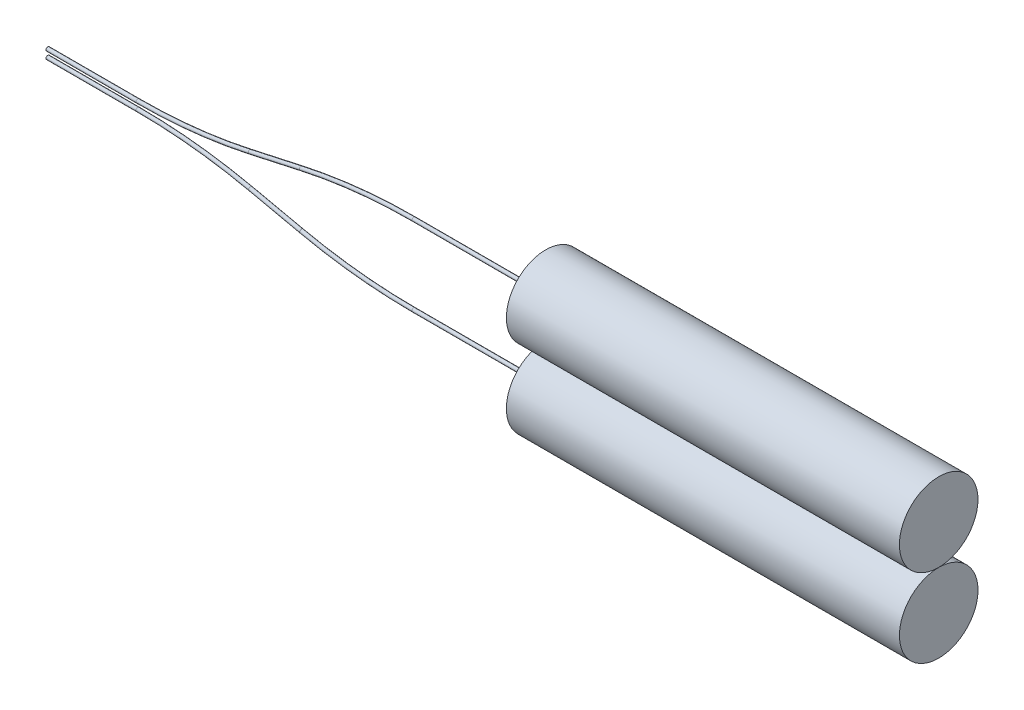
from build123d import *

# Parameters (mm, degrees)
SKIZZE1_R               = 1.5
LINEAR_AUSTRAGEN1_DEPTH = 15
SKIZZE4_R               = 0.07


with BuildPart() as part:
    # Skizze1 → Linear austragen1 (new body)
    with BuildSketch(Plane(origin=(18, 0, 0), x_dir=(0, 0, -1), z_dir=(1, 0, 0))):
        with Locations((0, 1.5)):
            Circle(SKIZZE1_R)
    extrude(amount=LINEAR_AUSTRAGEN1_DEPTH)

    # Austragung1: sweep along a path in Skizze3
    with BuildLine(Plane.XY) as austragung1_path:
        Line((-1, 0.14), (2.435425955, 0.14))
        ThreePointArc((2.435425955, 0.14), (4.593606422, 0.256784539), (6.726582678, 0.605774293))
        Line((6.726582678, 0.605774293), (8.676981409, 1.034225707))
        ThreePointArc((8.676981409, 1.034225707), (10.809957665, 1.383215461), (12.968138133, 1.5))
        Line((12.968138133, 1.5), (18, 1.5))
    # Skizze4 → Austragung1 (sweep)
    with BuildSketch(Plane.ZY.offset(1)):
        with Locations((0, 0.14)):
            Circle(SKIZZE4_R)
    sweep(path=austragung1_path.line)


with BuildPart() as body_2:
    # Spiegeln3: mirrored copy
    add(part.part.mirror(Plane.ZX))


solid = Compound([part.part, body_2.part])
